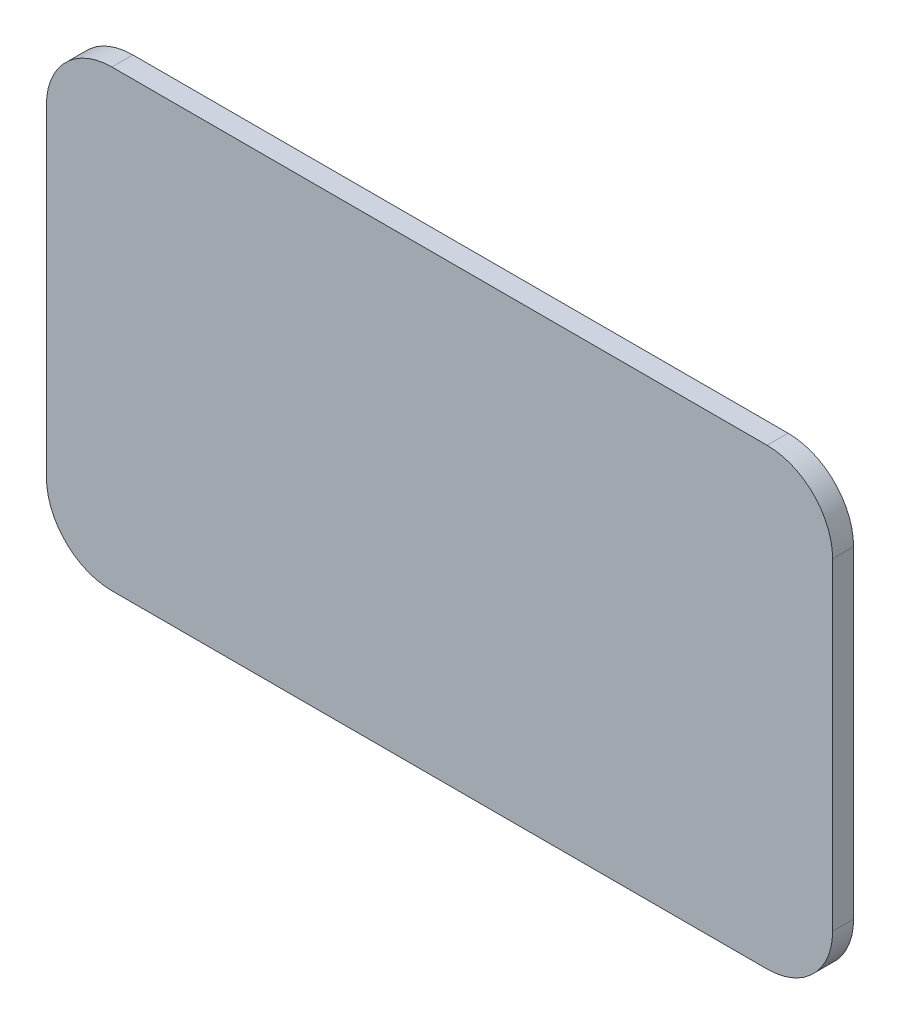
ISO-10303-21;
HEADER;
FILE_DESCRIPTION(('STEP AP214'),'2;1');
FILE_NAME('part.step','',(''),(''),'','','');
FILE_SCHEMA(('AUTOMOTIVE_DESIGN { 1 0 10303 214 1 1 1 1 }'));
ENDSEC;
DATA;
#1=APPLICATION_CONTEXT('core data for automotive mechanical design processes');
#2=APPLICATION_PROTOCOL_DEFINITION('international standard','automotive_design',2000,#1);
#3=PRODUCT_CONTEXT('',#1,'mechanical');
#4=PRODUCT('Part','Part','',(#3));
#5=PRODUCT_RELATED_PRODUCT_CATEGORY('part','',(#4));
#6=PRODUCT_DEFINITION_FORMATION('','',#4);
#7=PRODUCT_DEFINITION_CONTEXT('part definition',#1,'design');
#8=PRODUCT_DEFINITION('design','',#6,#7);
#9=PRODUCT_DEFINITION_SHAPE('','',#8);
#10=(LENGTH_UNIT() NAMED_UNIT(*) SI_UNIT(.MILLI.,.METRE.));
#11=(NAMED_UNIT(*) PLANE_ANGLE_UNIT() SI_UNIT($,.RADIAN.));
#12=(NAMED_UNIT(*) SI_UNIT($,.STERADIAN.) SOLID_ANGLE_UNIT());
#13=UNCERTAINTY_MEASURE_WITH_UNIT(LENGTH_MEASURE(1.E-05),#10,'distance_accuracy_value','');
#14=(GEOMETRIC_REPRESENTATION_CONTEXT(3) GLOBAL_UNCERTAINTY_ASSIGNED_CONTEXT((#13)) GLOBAL_UNIT_ASSIGNED_CONTEXT((#10,
#11,#12)) REPRESENTATION_CONTEXT('',''));
#15=CARTESIAN_POINT('',(0.,0.,0.));
#16=DIRECTION('',(0.,0.,1.));
#17=DIRECTION('',(1.,0.,0.));
#18=AXIS2_PLACEMENT_3D('',#15,#16,#17);
#19=CARTESIAN_POINT('',(-20.273,-5.12800108,1.6));
#20=DIRECTION('',(0.,0.,-1.));
#21=DIRECTION('',(-1.,0.,0.));
#22=AXIS2_PLACEMENT_3D('',#19,#20,#21);
#23=CYLINDRICAL_SURFACE('',#22,5.);
#24=CARTESIAN_POINT('',(-20.273,-5.12800108,0.));
#25=DIRECTION('',(0.,0.,1.));
#26=DIRECTION('',(1.,0.,0.));
#27=AXIS2_PLACEMENT_3D('',#24,#25,#26);
#28=CIRCLE('',#27,5.);
#29=CARTESIAN_POINT('',(-25.273,-5.12800108,0.));
#30=VERTEX_POINT('',#29);
#31=CARTESIAN_POINT('',(-20.273,-10.12800108,0.));
#32=VERTEX_POINT('',#31);
#33=EDGE_CURVE('E139',#30,#32,#28,.T.);
#34=ORIENTED_EDGE('',*,*,#33,.T.);
#35=DIRECTION('',(0.,0.,-1.));
#36=VECTOR('',#35,1.);
#37=CARTESIAN_POINT('',(-20.273,-10.12800108,1.6));
#38=LINE('',#37,#36);
#39=CARTESIAN_POINT('',(-20.273,-10.12800108,1.6));
#40=VERTEX_POINT('',#39);
#41=EDGE_CURVE('E11',#40,#32,#38,.T.);
#42=ORIENTED_EDGE('',*,*,#41,.F.);
#43=CARTESIAN_POINT('',(-20.273,-5.12800108,1.6));
#44=DIRECTION('',(0.,0.,1.));
#45=DIRECTION('',(1.,0.,0.));
#46=AXIS2_PLACEMENT_3D('',#43,#44,#45);
#47=CIRCLE('',#46,5.);
#48=CARTESIAN_POINT('',(-25.273,-5.12800108,1.6));
#49=VERTEX_POINT('',#48);
#50=EDGE_CURVE('E153',#49,#40,#47,.T.);
#51=ORIENTED_EDGE('',*,*,#50,.F.);
#52=DIRECTION('',(0.,0.,-1.));
#53=VECTOR('',#52,1.);
#54=CARTESIAN_POINT('',(-25.273,-5.12800108,1.6));
#55=LINE('',#54,#53);
#56=EDGE_CURVE('E135',#49,#30,#55,.T.);
#57=ORIENTED_EDGE('',*,*,#56,.T.);
#58=EDGE_LOOP('',(#34,#42,#51,#57));
#59=FACE_BOUND('',#58,.T.);
#60=ADVANCED_FACE('F43',(#59),#23,.T.);
#61=CARTESIAN_POINT('',(-20.273,-10.12800108,1.6));
#62=DIRECTION('',(0.,1.,0.));
#63=DIRECTION('',(0.,0.,1.));
#64=AXIS2_PLACEMENT_3D('',#61,#62,#63);
#65=PLANE('',#64);
#66=DIRECTION('',(1.,0.,0.));
#67=VECTOR('',#66,1.);
#68=CARTESIAN_POINT('',(-20.273,-10.12800108,0.));
#69=LINE('',#68,#67);
#70=CARTESIAN_POINT('',(29.72699938,-10.12800108,0.));
#71=VERTEX_POINT('',#70);
#72=EDGE_CURVE('E142',#32,#71,#69,.T.);
#73=ORIENTED_EDGE('',*,*,#72,.T.);
#74=DIRECTION('',(0.,0.,-1.));
#75=VECTOR('',#74,1.);
#76=CARTESIAN_POINT('',(29.72699938,-10.12800108,1.6));
#77=LINE('',#76,#75);
#78=CARTESIAN_POINT('',(29.72699938,-10.12800108,1.6));
#79=VERTEX_POINT('',#78);
#80=EDGE_CURVE('E51',#79,#71,#77,.T.);
#81=ORIENTED_EDGE('',*,*,#80,.F.);
#82=DIRECTION('',(1.,0.,0.));
#83=VECTOR('',#82,1.);
#84=CARTESIAN_POINT('',(-20.273,-10.12800108,1.6));
#85=LINE('',#84,#83);
#86=EDGE_CURVE('E102',#40,#79,#85,.T.);
#87=ORIENTED_EDGE('',*,*,#86,.F.);
#88=ORIENTED_EDGE('',*,*,#41,.T.);
#89=EDGE_LOOP('',(#73,#81,#87,#88));
#90=FACE_BOUND('',#89,.T.);
#91=ADVANCED_FACE('F188',(#90),#65,.F.);
#92=CARTESIAN_POINT('',(29.72699938,-5.12800107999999,1.6));
#93=DIRECTION('',(0.,0.,-1.));
#94=DIRECTION('',(-1.,0.,0.));
#95=AXIS2_PLACEMENT_3D('',#92,#93,#94);
#96=CYLINDRICAL_SURFACE('',#95,5.00000000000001);
#97=CARTESIAN_POINT('',(29.72699938,-5.12800107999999,0.));
#98=DIRECTION('',(0.,0.,1.));
#99=DIRECTION('',(1.,0.,0.));
#100=AXIS2_PLACEMENT_3D('',#97,#98,#99);
#101=CIRCLE('',#100,5.00000000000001);
#102=CARTESIAN_POINT('',(34.72699938,-5.12800107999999,0.));
#103=VERTEX_POINT('',#102);
#104=EDGE_CURVE('E144',#71,#103,#101,.T.);
#105=ORIENTED_EDGE('',*,*,#104,.T.);
#106=DIRECTION('',(0.,0.,-1.));
#107=VECTOR('',#106,1.);
#108=CARTESIAN_POINT('',(34.72699938,-5.12800107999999,1.6));
#109=LINE('',#108,#107);
#110=CARTESIAN_POINT('',(34.72699938,-5.12800107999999,1.6));
#111=VERTEX_POINT('',#110);
#112=EDGE_CURVE('E160',#111,#103,#109,.T.);
#113=ORIENTED_EDGE('',*,*,#112,.F.);
#114=CARTESIAN_POINT('',(29.72699938,-5.12800107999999,1.6));
#115=DIRECTION('',(0.,0.,1.));
#116=DIRECTION('',(1.,0.,0.));
#117=AXIS2_PLACEMENT_3D('',#114,#115,#116);
#118=CIRCLE('',#117,5.00000000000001);
#119=EDGE_CURVE('E168',#79,#111,#118,.T.);
#120=ORIENTED_EDGE('',*,*,#119,.F.);
#121=ORIENTED_EDGE('',*,*,#80,.T.);
#122=EDGE_LOOP('',(#105,#113,#120,#121));
#123=FACE_BOUND('',#122,.T.);
#124=ADVANCED_FACE('F166',(#123),#96,.T.);
#125=CARTESIAN_POINT('',(34.72699938,-5.12800108,1.6));
#126=DIRECTION('',(-1.,0.,0.));
#127=DIRECTION('',(0.,0.,1.));
#128=AXIS2_PLACEMENT_3D('',#125,#126,#127);
#129=PLANE('',#128);
#130=DIRECTION('',(0.,1.,0.));
#131=VECTOR('',#130,1.);
#132=CARTESIAN_POINT('',(34.72699938,-5.12800108,0.));
#133=LINE('',#132,#131);
#134=CARTESIAN_POINT('',(34.72699938,19.49100004,0.));
#135=VERTEX_POINT('',#134);
#136=EDGE_CURVE('E146',#103,#135,#133,.T.);
#137=ORIENTED_EDGE('',*,*,#136,.T.);
#138=DIRECTION('',(0.,0.,-1.));
#139=VECTOR('',#138,1.);
#140=CARTESIAN_POINT('',(34.72699938,19.49100004,1.6));
#141=LINE('',#140,#139);
#142=CARTESIAN_POINT('',(34.72699938,19.49100004,1.6));
#143=VERTEX_POINT('',#142);
#144=EDGE_CURVE('E157',#143,#135,#141,.T.);
#145=ORIENTED_EDGE('',*,*,#144,.F.);
#146=DIRECTION('',(0.,1.,0.));
#147=VECTOR('',#146,1.);
#148=CARTESIAN_POINT('',(34.72699938,-5.12800108,1.6));
#149=LINE('',#148,#147);
#150=EDGE_CURVE('E180',#111,#143,#149,.T.);
#151=ORIENTED_EDGE('',*,*,#150,.F.);
#152=ORIENTED_EDGE('',*,*,#112,.T.);
#153=EDGE_LOOP('',(#137,#145,#151,#152));
#154=FACE_BOUND('',#153,.T.);
#155=ADVANCED_FACE('F176',(#154),#129,.F.);
#156=CARTESIAN_POINT('',(29.72699938,19.49100004,1.6));
#157=DIRECTION('',(0.,0.,-1.));
#158=DIRECTION('',(-1.,0.,0.));
#159=AXIS2_PLACEMENT_3D('',#156,#157,#158);
#160=CYLINDRICAL_SURFACE('',#159,5.);
#161=CARTESIAN_POINT('',(29.72699938,19.49100004,0.));
#162=DIRECTION('',(0.,0.,1.));
#163=DIRECTION('',(1.,0.,0.));
#164=AXIS2_PLACEMENT_3D('',#161,#162,#163);
#165=CIRCLE('',#164,5.);
#166=CARTESIAN_POINT('',(29.72699938,24.49100004,0.));
#167=VERTEX_POINT('',#166);
#168=EDGE_CURVE('E148',#135,#167,#165,.T.);
#169=ORIENTED_EDGE('',*,*,#168,.T.);
#170=DIRECTION('',(0.,0.,-1.));
#171=VECTOR('',#170,1.);
#172=CARTESIAN_POINT('',(29.72699938,24.49100004,1.6));
#173=LINE('',#172,#171);
#174=CARTESIAN_POINT('',(29.72699938,24.49100004,1.6));
#175=VERTEX_POINT('',#174);
#176=EDGE_CURVE('E130',#175,#167,#173,.T.);
#177=ORIENTED_EDGE('',*,*,#176,.F.);
#178=CARTESIAN_POINT('',(29.72699938,19.49100004,1.6));
#179=DIRECTION('',(0.,0.,1.));
#180=DIRECTION('',(1.,0.,0.));
#181=AXIS2_PLACEMENT_3D('',#178,#179,#180);
#182=CIRCLE('',#181,5.);
#183=EDGE_CURVE('E121',#143,#175,#182,.T.);
#184=ORIENTED_EDGE('',*,*,#183,.F.);
#185=ORIENTED_EDGE('',*,*,#144,.T.);
#186=EDGE_LOOP('',(#169,#177,#184,#185));
#187=FACE_BOUND('',#186,.T.);
#188=ADVANCED_FACE('F179',(#187),#160,.T.);
#189=CARTESIAN_POINT('',(29.72699938,24.49100004,1.6));
#190=DIRECTION('',(0.,-1.,0.));
#191=DIRECTION('',(0.,0.,-1.));
#192=AXIS2_PLACEMENT_3D('',#189,#190,#191);
#193=PLANE('',#192);
#194=DIRECTION('',(-1.,0.,0.));
#195=VECTOR('',#194,1.);
#196=CARTESIAN_POINT('',(29.72699938,24.49100004,0.));
#197=LINE('',#196,#195);
#198=CARTESIAN_POINT('',(-20.273,24.49100004,0.));
#199=VERTEX_POINT('',#198);
#200=EDGE_CURVE('E129',#167,#199,#197,.T.);
#201=ORIENTED_EDGE('',*,*,#200,.T.);
#202=DIRECTION('',(0.,0.,-1.));
#203=VECTOR('',#202,1.);
#204=CARTESIAN_POINT('',(-20.273,24.49100004,1.6));
#205=LINE('',#204,#203);
#206=CARTESIAN_POINT('',(-20.273,24.49100004,1.6));
#207=VERTEX_POINT('',#206);
#208=EDGE_CURVE('E126',#207,#199,#205,.T.);
#209=ORIENTED_EDGE('',*,*,#208,.F.);
#210=DIRECTION('',(-1.,0.,0.));
#211=VECTOR('',#210,1.);
#212=CARTESIAN_POINT('',(29.72699938,24.49100004,1.6));
#213=LINE('',#212,#211);
#214=EDGE_CURVE('E115',#175,#207,#213,.T.);
#215=ORIENTED_EDGE('',*,*,#214,.F.);
#216=ORIENTED_EDGE('',*,*,#176,.T.);
#217=EDGE_LOOP('',(#201,#209,#215,#216));
#218=FACE_BOUND('',#217,.T.);
#219=ADVANCED_FACE('F127',(#218),#193,.F.);
#220=CARTESIAN_POINT('',(-20.273,19.49100004,1.6));
#221=DIRECTION('',(0.,0.,-1.));
#222=DIRECTION('',(-1.,0.,0.));
#223=AXIS2_PLACEMENT_3D('',#220,#221,#222);
#224=CYLINDRICAL_SURFACE('',#223,5.);
#225=CARTESIAN_POINT('',(-20.273,19.49100004,0.));
#226=DIRECTION('',(0.,0.,1.));
#227=DIRECTION('',(1.,0.,0.));
#228=AXIS2_PLACEMENT_3D('',#225,#226,#227);
#229=CIRCLE('',#228,5.);
#230=CARTESIAN_POINT('',(-25.273,19.49100004,0.));
#231=VERTEX_POINT('',#230);
#232=EDGE_CURVE('E88',#199,#231,#229,.T.);
#233=ORIENTED_EDGE('',*,*,#232,.T.);
#234=DIRECTION('',(0.,0.,-1.));
#235=VECTOR('',#234,1.);
#236=CARTESIAN_POINT('',(-25.273,19.49100004,1.6));
#237=LINE('',#236,#235);
#238=CARTESIAN_POINT('',(-25.273,19.49100004,1.6));
#239=VERTEX_POINT('',#238);
#240=EDGE_CURVE('E131',#239,#231,#237,.T.);
#241=ORIENTED_EDGE('',*,*,#240,.F.);
#242=CARTESIAN_POINT('',(-20.273,19.49100004,1.6));
#243=DIRECTION('',(0.,0.,1.));
#244=DIRECTION('',(1.,0.,0.));
#245=AXIS2_PLACEMENT_3D('',#242,#243,#244);
#246=CIRCLE('',#245,5.);
#247=EDGE_CURVE('E119',#207,#239,#246,.T.);
#248=ORIENTED_EDGE('',*,*,#247,.F.);
#249=ORIENTED_EDGE('',*,*,#208,.T.);
#250=EDGE_LOOP('',(#233,#241,#248,#249));
#251=FACE_BOUND('',#250,.T.);
#252=ADVANCED_FACE('F133',(#251),#224,.T.);
#253=CARTESIAN_POINT('',(-25.273,19.49100004,1.6));
#254=DIRECTION('',(1.,0.,0.));
#255=DIRECTION('',(0.,0.,-1.));
#256=AXIS2_PLACEMENT_3D('',#253,#254,#255);
#257=PLANE('',#256);
#258=DIRECTION('',(0.,-1.,0.));
#259=VECTOR('',#258,1.);
#260=CARTESIAN_POINT('',(-25.273,19.49100004,0.));
#261=LINE('',#260,#259);
#262=EDGE_CURVE('E94',#231,#30,#261,.T.);
#263=ORIENTED_EDGE('',*,*,#262,.T.);
#264=ORIENTED_EDGE('',*,*,#56,.F.);
#265=DIRECTION('',(0.,-1.,0.));
#266=VECTOR('',#265,1.);
#267=CARTESIAN_POINT('',(-25.273,19.49100004,1.6));
#268=LINE('',#267,#266);
#269=EDGE_CURVE('E59',#239,#49,#268,.T.);
#270=ORIENTED_EDGE('',*,*,#269,.F.);
#271=ORIENTED_EDGE('',*,*,#240,.T.);
#272=EDGE_LOOP('',(#263,#264,#270,#271));
#273=FACE_BOUND('',#272,.T.);
#274=ADVANCED_FACE('F204',(#273),#257,.F.);
#275=CARTESIAN_POINT('',(-20.273,-5.12800108,1.6));
#276=DIRECTION('',(0.,0.,1.));
#277=DIRECTION('',(1.,0.,0.));
#278=AXIS2_PLACEMENT_3D('',#275,#276,#277);
#279=PLANE('',#278);
#280=ORIENTED_EDGE('',*,*,#50,.T.);
#281=ORIENTED_EDGE('',*,*,#86,.T.);
#282=ORIENTED_EDGE('',*,*,#119,.T.);
#283=ORIENTED_EDGE('',*,*,#150,.T.);
#284=ORIENTED_EDGE('',*,*,#183,.T.);
#285=ORIENTED_EDGE('',*,*,#214,.T.);
#286=ORIENTED_EDGE('',*,*,#247,.T.);
#287=ORIENTED_EDGE('',*,*,#269,.T.);
#288=EDGE_LOOP('',(#280,#281,#282,#283,#284,#285,#286,#287));
#289=FACE_BOUND('',#288,.T.);
#290=ADVANCED_FACE('F117',(#289),#279,.T.);
#291=CARTESIAN_POINT('',(-20.273,-5.12800108,0.));
#292=DIRECTION('',(0.,0.,1.));
#293=DIRECTION('',(1.,0.,0.));
#294=AXIS2_PLACEMENT_3D('',#291,#292,#293);
#295=PLANE('',#294);
#296=ORIENTED_EDGE('',*,*,#33,.F.);
#297=ORIENTED_EDGE('',*,*,#262,.F.);
#298=ORIENTED_EDGE('',*,*,#232,.F.);
#299=ORIENTED_EDGE('',*,*,#200,.F.);
#300=ORIENTED_EDGE('',*,*,#168,.F.);
#301=ORIENTED_EDGE('',*,*,#136,.F.);
#302=ORIENTED_EDGE('',*,*,#104,.F.);
#303=ORIENTED_EDGE('',*,*,#72,.F.);
#304=EDGE_LOOP('',(#296,#297,#298,#299,#300,#301,#302,#303));
#305=FACE_BOUND('',#304,.T.);
#306=ADVANCED_FACE('F172',(#305),#295,.F.);
#307=CLOSED_SHELL('',(#60,#91,#124,#155,#188,#219,#252,#274,#290,#306));
#308=MANIFOLD_SOLID_BREP('B2',#307);
#309=ADVANCED_BREP_SHAPE_REPRESENTATION('',(#18,#308),#14);
#310=SHAPE_DEFINITION_REPRESENTATION(#9,#309);
ENDSEC;
END-ISO-10303-21;
